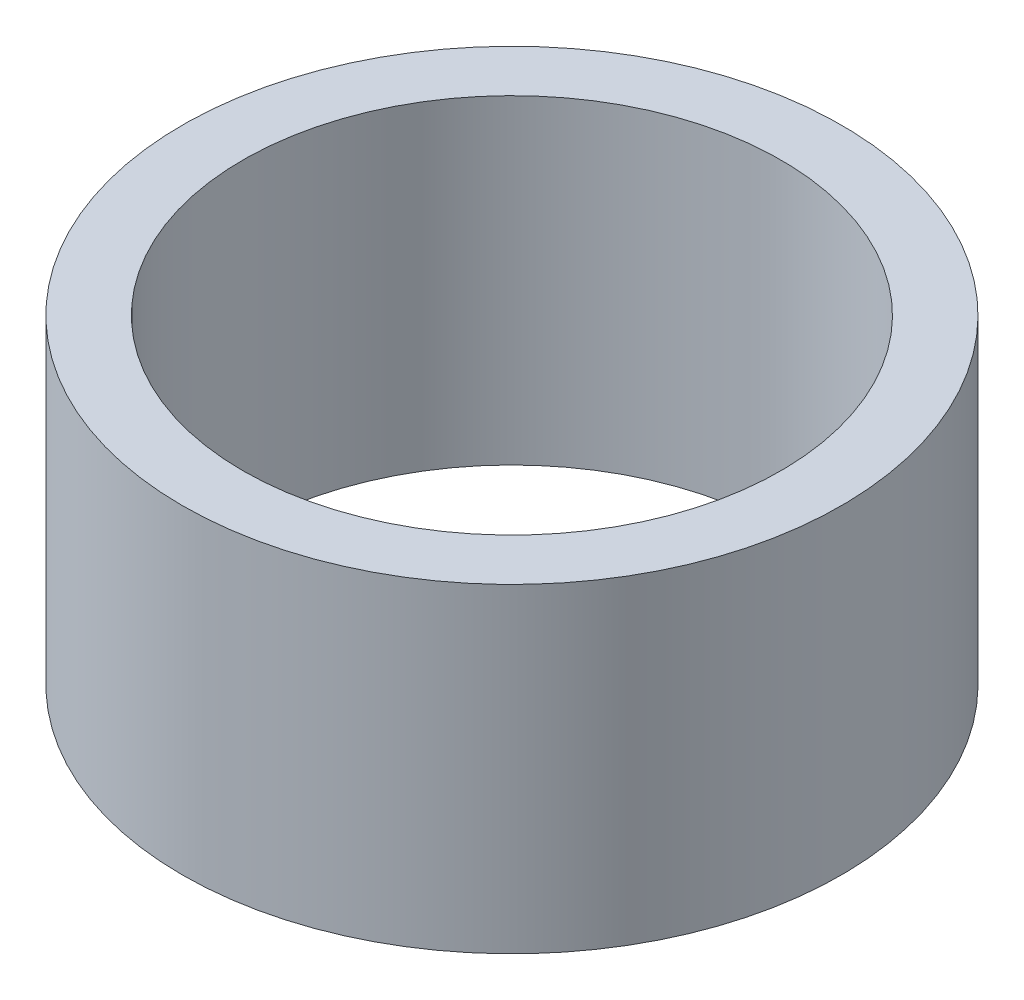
from build123d import *

# Parameters (mm, degrees)
SKETCH3_R           = 34.6075
SKETCH3_R_2         = 28.2575
BOSS_EXTRUDE1_DEPTH = 33.58896


with BuildPart() as part:
    # Sketch3 → Boss-Extrude1 (new body)
    with BuildSketch(Plane(origin=(0, 0, 0), x_dir=(1, 0, 0), z_dir=(0, 1, 0))):
        with Locations(Location((0, 0, 0), (0, 0, 270))):
            Circle(SKETCH3_R)
        with Locations(Location((0, 0, 0), (0, 0, 270))):
            Circle(SKETCH3_R_2, mode=Mode.SUBTRACT)
    extrude(amount=BOSS_EXTRUDE1_DEPTH)


solid = part.part
